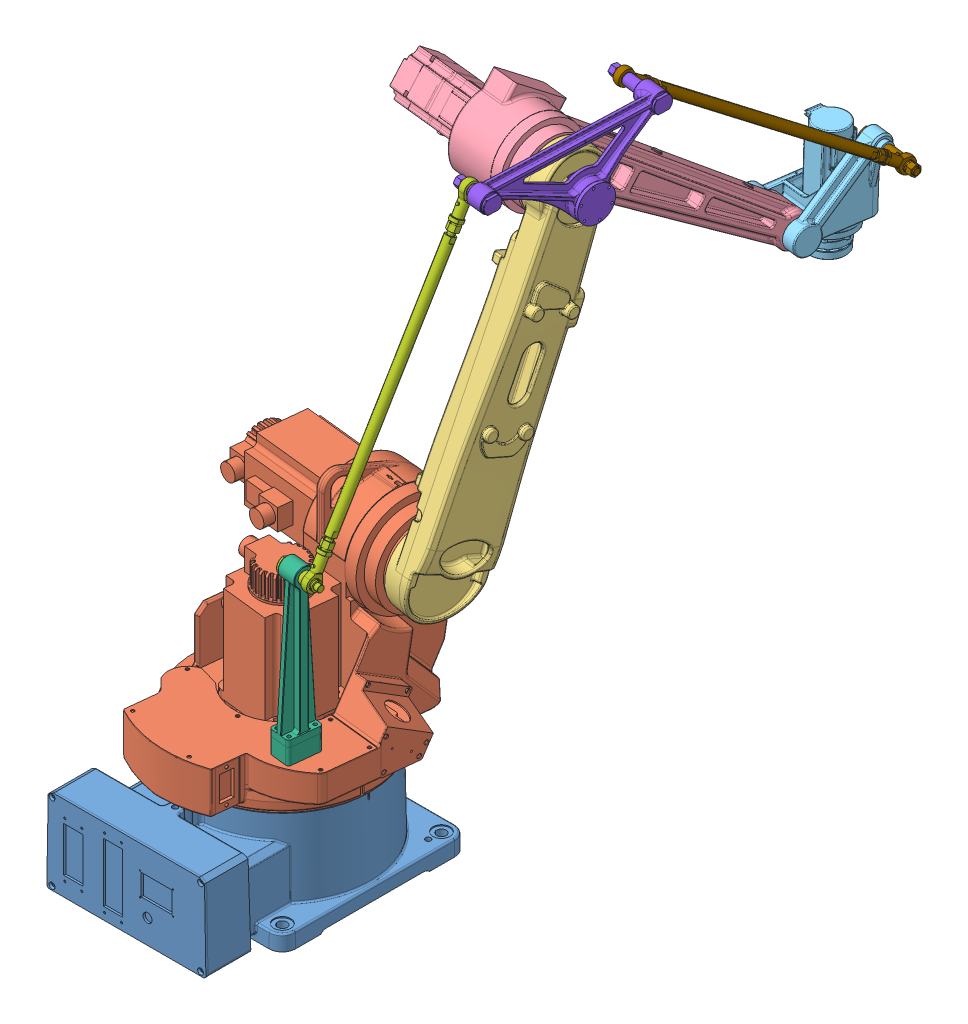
SolidWorks assembly TKB-4600.SLDASM, configuration 默认 (file format 11000). Lengths in mm.
Overall size (540.1 1274.16 1288.39).
9 component instances, 9 part files, 19 mates.
Components (placement in the parent):
- TKB1400-00-1: TKB1400-00.SLDPRT [默认] at (-28.1584 -93.0396 409.6497) size (350.03 178 469.26)
- TKB1400-01-1: TKB1400-01.SLDPRT [默认] at (-28.1584 -91.0396 409.6497) x (0.994233 0 0.107237) z (-0.107237 0 0.994233) size (440.24 404.37 477.67)
- TKB1400-02-1: TKB1400-02.SLDPRT [默认] at (100.3537 358.9604 262.5829) x (0.100464 -0.349741 -0.931444) z (0.994233 0 0.107237) size (153.86 731.97 109.36)
- TKB4600-03-1: TKB4600-03.SLDPRT [默认] at (12.1218 911.6998 45.5222) x (0.086194 -0.594933 -0.799141) z (-0.994233 0 -0.107237) size (703 155 297.2)
- TKB4600-05-01-1: TKB4600-05-01.SLDPRT [默认] at (73.8922 658.7664 -555.1499) x (0.107175 -0.033958 -0.99366) z (0.994233 0 0.107237) size (164.69 206 148.01)
- TKB4600-04-1: TKB4600-04.SLDPRT [默认] at (179.4147 952.3144 256.94) x (0.061086 -0.821897 -0.566351) z (-0.994233 0 -0.107237) size (276.67 209.94 40)
- TKB4600-04 - 2-1: TKB4600-04 - 2.SLDPRT [默认] at (194.5744 843.4954 116.3891) x (0.029535 -0.961324 -0.273832) z (-0.994233 0 -0.107237) size (472.9 445.85 77.07)
- TKB4600-04 - 3-1: TKB4600-04 - 3.SLDPRT [默认] at (200.0319 911.6998 65.79) x (0.069722 -0.759794 -0.646415) z (-0.994233 0 -0.107237) size (231.26 279.52 123.13)
- TKB4600-04 - 4-1: TKB4600-04 - 4.SLDPRT [默认] at (196.0838 993.0457 102.395) x (0.015201 -0.989902 -0.140935) z (-0.994233 0 -0.107237) size (464.14 469.22 108)
Mates (geometry in assembly coordinates):
- 同心1: concentric: cone of TKB1400-00-1 through (-28.1584 86.9604 409.6497) axis (0 1 0); cone of TKB1400-01-1 through (-28.1584 140.9604 409.6497) axis (0 1 0)
- 重合1: coincident: plane of TKB1400-00-1 through (-192.1584 81.9604 409.6497) normal (0 1 0); plane of TKB1400-01-1 through (-28.1584 81.9604 409.6497) normal (0 -1 0)
- 同心2: concentric: cylinder of TKB1400-01-1 through (-163.2202 358.9604 234.1541) axis (0.994233 0 0.107237) radius 81; cone of TKB1400-02-1 through (128.1922 358.9604 265.5855) axis (-0.994233 0 -0.107237)
- 重合2: coincident: plane of TKB1400-01-1 through (90.4764 358.9604 307.5329) normal (0.994233 0 0.107237); plane of TKB1400-02-1 through (95.3825 358.9604 262.0467) normal (-0.994233 0 -0.107237)
- 重合3: coincident: plane of TKB1400-02-1 through (138.3895 911.6998 59.1413) normal (-0.994233 0 -0.107237); plane of TKB4600-03-1 through (138.3895 911.6998 59.1413) normal (0.994233 0 0.107237)
- 同心3: concentric: cone of TKB1400-02-1 through (150.3203 911.6998 60.4281) axis (-0.994233 0 -0.107237); cylinder of TKB4600-03-1 through (108.5624 911.6998 55.9242) axis (-0.994233 0 -0.107237) radius 72.5
- 同心4: concentric: cylinder of TKB4600-03-1 through (29.0403 554.7402 -437.7154) axis (0.994233 0 0.107237) radius 30; circle of TKB4600-05-01-1
- 重合4: coincident: plane of TKB4600-03-1 through (103.3462 549.6833 -436.5726) normal (0.994233 0 0.107237); plane of TKB4600-05-01-1 through (102.6135 554.7402 -429.7799) normal (-0.994233 0 -0.107237)
- 重合6: coincident: plane of TKB1400-01-1 through (42.2356 174.9604 614.9146) normal (0 1 0); plane of TKB4600-04-1 through (96.948 174.9604 508.6365) normal (0 -1 0)
- 同心7: concentric: cylinder of TKB4600-04-1 through (114.3471 469.5004 510.5132) axis (-0.994233 0 -0.107237) radius 17.5; cylinder of TKB4600-04 - 2-1 through (74.5778 469.5004 506.2237) axis (-0.994233 0 -0.107237) radius 8
- 重合7: coincident: plane of TKB4600-04-1 through (114.3471 216.9604 510.5132) normal (0.994233 0 0.107237); plane of TKB4600-04 - 2-1 through (114.3471 469.5004 510.5132) normal (-0.994233 0 -0.107237)
- 同心8: concentric: cone of TKB1400-02-1 through (150.3203 911.6998 60.4281) axis (0.994233 0 0.107237); cylinder of TKB4600-04 - 3-1 through (159.2684 911.6998 61.3933) axis (-0.994233 0 -0.107237) radius 23
- 同心9: concentric: cylinder of TKB4600-04 - 2-1 through (109.171 994.467 239.1161) axis (0.994233 0 0.107237) radius 6; cylinder of TKB4600-04 - 3-1 through (209.34 994.467 249.9202) axis (0.994233 0 0.107237) radius 6
- 同心10: concentric: cylinder of TKB4600-05-01-1 through (146.4713 658.7664 -547.3216) axis (0.994233 0 0.107237) radius 13; cylinder of TKB4600-04 - 4-1 through (111.6731 658.7664 -551.0749) axis (-0.994233 0 -0.107237) radius 8
- 重合8: coincident: plane of TKB4600-05-01-1 through (156.0624 658.5627 -552.3184) normal (0.994233 0 0.107237); plane of TKB4600-04 - 4-1 through (155.4194 658.7664 -546.3565) normal (-0.994233 0 -0.107237)
- 同心11: concentric: cylinder of TKB4600-04 - 3-1 through (226.9877 1015.726 -53.5747) axis (0.994233 0 0.107237) radius 6; cylinder of TKB4600-04 - 4-1 through (93.7604 1015.726 -67.9445) axis (0.994233 0 0.107237) radius 6
- 重合10: coincident: plane of TKB4600-04 - 3-1 through (134.5491 1016.654 -54.4559) normal (0.994233 0 0.107237); plane of TKB4600-04 - 4-1 through (134.9752 1019.4741 -58.4059) normal (-0.994233 0 -0.107237)
- 重合11: coincident: plane of TKB4600-04 - 2-1 through (151.2372 1000.0726 240.7613) normal (-0.994233 0 -0.107237); plane of TKB4600-04 - 3-1 through (149.9575 995.1557 252.626) normal (0.994233 0 0.107237)
- 距离1: distance = 115 mm: plane of TKB4600-04-1 through (113.6156 204.9604 540.6083) normal (-0.107237 0 0.994233); cylinder of TKB1400-01-1 through (-28.1584 413.9604 409.6497) axis (0 1 0) radius 170
